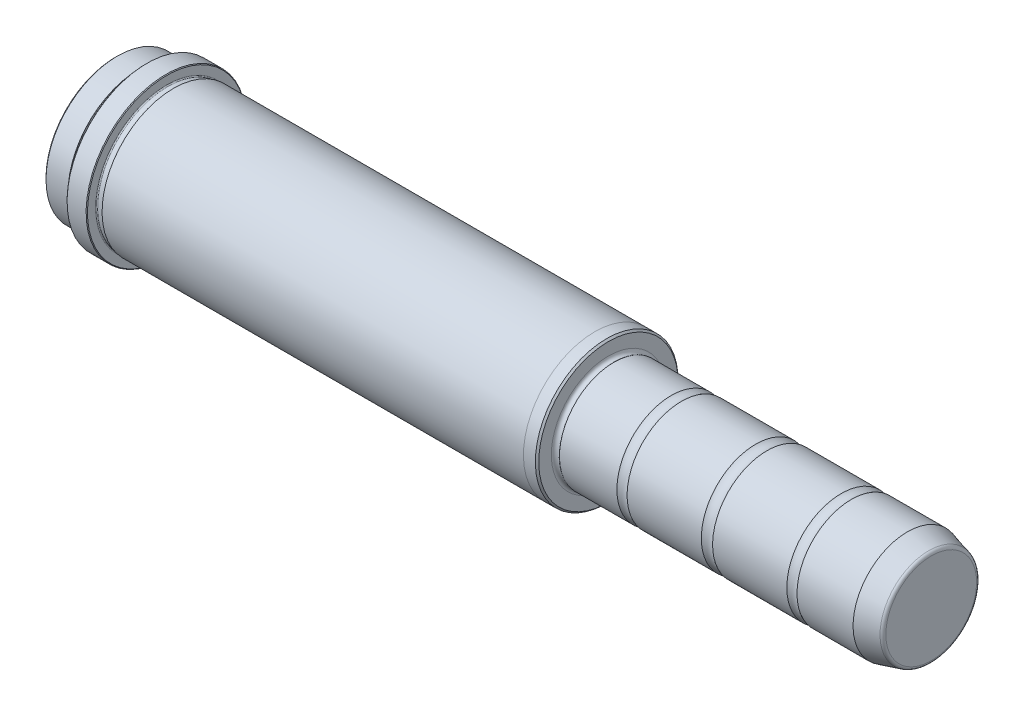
ISO-10303-21;
HEADER;
FILE_DESCRIPTION(('STEP AP214'),'2;1');
FILE_NAME('part.step','',(''),(''),'','','');
FILE_SCHEMA(('AUTOMOTIVE_DESIGN { 1 0 10303 214 1 1 1 1 }'));
ENDSEC;
DATA;
#1=APPLICATION_CONTEXT('core data for automotive mechanical design processes');
#2=APPLICATION_PROTOCOL_DEFINITION('international standard','automotive_design',2000,#1);
#3=PRODUCT_CONTEXT('',#1,'mechanical');
#4=PRODUCT('Part','Part','',(#3));
#5=PRODUCT_RELATED_PRODUCT_CATEGORY('part','',(#4));
#6=PRODUCT_DEFINITION_FORMATION('','',#4);
#7=PRODUCT_DEFINITION_CONTEXT('part definition',#1,'design');
#8=PRODUCT_DEFINITION('design','',#6,#7);
#9=PRODUCT_DEFINITION_SHAPE('','',#8);
#10=(LENGTH_UNIT() NAMED_UNIT(*) SI_UNIT(.MILLI.,.METRE.));
#11=(NAMED_UNIT(*) PLANE_ANGLE_UNIT() SI_UNIT($,.RADIAN.));
#12=(NAMED_UNIT(*) SI_UNIT($,.STERADIAN.) SOLID_ANGLE_UNIT());
#13=UNCERTAINTY_MEASURE_WITH_UNIT(LENGTH_MEASURE(1.E-05),#10,'distance_accuracy_value','');
#14=(GEOMETRIC_REPRESENTATION_CONTEXT(3) GLOBAL_UNCERTAINTY_ASSIGNED_CONTEXT((#13)) GLOBAL_UNIT_ASSIGNED_CONTEXT((#10,
#11,#12)) REPRESENTATION_CONTEXT('',''));
#15=CARTESIAN_POINT('',(0.,0.,0.));
#16=DIRECTION('',(0.,0.,1.));
#17=DIRECTION('',(1.,0.,0.));
#18=AXIS2_PLACEMENT_3D('',#15,#16,#17);
#19=CARTESIAN_POINT('',(95.,0.,0.));
#20=DIRECTION('',(1.,0.,0.));
#21=DIRECTION('',(0.,1.,0.));
#22=AXIS2_PLACEMENT_3D('',#19,#20,#21);
#23=CYLINDRICAL_SURFACE('',#22,16.);
#24=CARTESIAN_POINT('',(1.6,0.,0.));
#25=DIRECTION('',(1.,0.,0.));
#26=DIRECTION('',(0.,1.,0.));
#27=AXIS2_PLACEMENT_3D('',#24,#25,#26);
#28=CIRCLE('',#27,16.);
#29=CARTESIAN_POINT('',(1.6,16.,0.));
#30=VERTEX_POINT('',#29);
#31=EDGE_CURVE('E105',#30,#30,#28,.T.);
#32=ORIENTED_EDGE('',*,*,#31,.T.);
#33=EDGE_LOOP('',(#32));
#34=FACE_BOUND('',#33,.T.);
#35=CARTESIAN_POINT('',(18.5033370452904,0.,0.));
#36=DIRECTION('',(-1.,0.,0.));
#37=DIRECTION('',(0.,-1.,0.));
#38=AXIS2_PLACEMENT_3D('',#35,#36,#37);
#39=CIRCLE('',#38,16.);
#40=CARTESIAN_POINT('',(18.5033370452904,-16.,0.));
#41=VERTEX_POINT('',#40);
#42=EDGE_CURVE('E126',#41,#41,#39,.T.);
#43=ORIENTED_EDGE('',*,*,#42,.T.);
#44=EDGE_LOOP('',(#43));
#45=FACE_BOUND('',#44,.T.);
#46=ADVANCED_FACE('F28',(#34,#45),#23,.T.);
#47=CARTESIAN_POINT('',(-145.,21.,0.));
#48=DIRECTION('',(-1.,0.,0.));
#49=DIRECTION('',(0.,-1.,0.));
#50=AXIS2_PLACEMENT_3D('',#47,#48,#49);
#51=PLANE('',#50);
#52=CARTESIAN_POINT('',(-145.,0.,0.));
#53=DIRECTION('',(-1.,0.,0.));
#54=DIRECTION('',(0.,-1.,0.));
#55=AXIS2_PLACEMENT_3D('',#52,#53,#54);
#56=CIRCLE('',#55,20.5000000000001);
#57=CARTESIAN_POINT('',(-145.,-20.5000000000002,0.));
#58=VERTEX_POINT('',#57);
#59=EDGE_CURVE('E39',#58,#58,#56,.T.);
#60=ORIENTED_EDGE('',*,*,#59,.T.);
#61=EDGE_LOOP('',(#60));
#62=FACE_BOUND('',#61,.T.);
#63=ADVANCED_FACE('F149',(#62),#51,.T.);
#64=CARTESIAN_POINT('',(95.,0.,0.));
#65=DIRECTION('',(1.,0.,0.));
#66=DIRECTION('',(0.,1.,0.));
#67=AXIS2_PLACEMENT_3D('',#64,#65,#66);
#68=CYLINDRICAL_SURFACE('',#67,21.);
#69=CARTESIAN_POINT('',(-144.5,0.,0.));
#70=DIRECTION('',(-1.,0.,0.));
#71=DIRECTION('',(0.,-1.,0.));
#72=AXIS2_PLACEMENT_3D('',#69,#70,#71);
#73=CIRCLE('',#72,21.);
#74=CARTESIAN_POINT('',(-144.5,-21.0000000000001,0.));
#75=VERTEX_POINT('',#74);
#76=EDGE_CURVE('E43',#75,#75,#73,.F.);
#77=ORIENTED_EDGE('',*,*,#76,.T.);
#78=EDGE_LOOP('',(#77));
#79=FACE_BOUND('',#78,.T.);
#80=CARTESIAN_POINT('',(-138.,0.,0.));
#81=DIRECTION('',(1.,0.,0.));
#82=DIRECTION('',(0.,1.,0.));
#83=AXIS2_PLACEMENT_3D('',#80,#81,#82);
#84=CIRCLE('',#83,21.);
#85=CARTESIAN_POINT('',(-138.,21.,0.));
#86=VERTEX_POINT('',#85);
#87=EDGE_CURVE('E66',#86,#86,#84,.T.);
#88=ORIENTED_EDGE('',*,*,#87,.F.);
#89=EDGE_LOOP('',(#88));
#90=FACE_BOUND('',#89,.T.);
#91=ADVANCED_FACE('F157',(#79,#90),#68,.T.);
#92=CARTESIAN_POINT('',(-138.,20.9,0.));
#93=DIRECTION('',(1.,0.,0.));
#94=DIRECTION('',(0.,1.,0.));
#95=AXIS2_PLACEMENT_3D('',#92,#93,#94);
#96=PLANE('',#95);
#97=ORIENTED_EDGE('',*,*,#87,.T.);
#98=EDGE_LOOP('',(#97));
#99=FACE_BOUND('',#98,.T.);
#100=CARTESIAN_POINT('',(-138.,0.,0.));
#101=DIRECTION('',(1.,0.,0.));
#102=DIRECTION('',(0.,1.,0.));
#103=AXIS2_PLACEMENT_3D('',#100,#101,#102);
#104=CIRCLE('',#103,20.9);
#105=CARTESIAN_POINT('',(-138.,20.9,0.));
#106=VERTEX_POINT('',#105);
#107=EDGE_CURVE('E69',#106,#106,#104,.T.);
#108=ORIENTED_EDGE('',*,*,#107,.F.);
#109=EDGE_LOOP('',(#108));
#110=FACE_BOUND('',#109,.T.);
#111=ADVANCED_FACE('F405',(#99,#110),#96,.T.);
#112=CARTESIAN_POINT('',(-137.7,0.,0.));
#113=DIRECTION('',(1.,0.,0.));
#114=DIRECTION('',(0.,1.,0.));
#115=AXIS2_PLACEMENT_3D('',#112,#113,#114);
#116=TOROIDAL_SURFACE('',#115,20.9,0.299999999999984);
#117=ORIENTED_EDGE('',*,*,#107,.T.);
#118=EDGE_LOOP('',(#117));
#119=FACE_BOUND('',#118,.T.);
#120=CARTESIAN_POINT('',(-137.7,0.,0.));
#121=DIRECTION('',(1.,0.,0.));
#122=DIRECTION('',(0.,1.,0.));
#123=AXIS2_PLACEMENT_3D('',#120,#121,#122);
#124=CIRCLE('',#123,20.6);
#125=CARTESIAN_POINT('',(-137.7,20.6,0.));
#126=VERTEX_POINT('',#125);
#127=EDGE_CURVE('E72',#126,#126,#124,.T.);
#128=ORIENTED_EDGE('',*,*,#127,.F.);
#129=EDGE_LOOP('',(#128));
#130=FACE_BOUND('',#129,.T.);
#131=ADVANCED_FACE('F396',(#119,#130),#116,.F.);
#132=CARTESIAN_POINT('',(95.,0.,0.));
#133=DIRECTION('',(1.,0.,0.));
#134=DIRECTION('',(0.,1.,0.));
#135=AXIS2_PLACEMENT_3D('',#132,#133,#134);
#136=CYLINDRICAL_SURFACE('',#135,20.6);
#137=ORIENTED_EDGE('',*,*,#127,.T.);
#138=EDGE_LOOP('',(#137));
#139=FACE_BOUND('',#138,.T.);
#140=CARTESIAN_POINT('',(-136.3,0.,0.));
#141=DIRECTION('',(1.,0.,0.));
#142=DIRECTION('',(0.,1.,0.));
#143=AXIS2_PLACEMENT_3D('',#140,#141,#142);
#144=CIRCLE('',#143,20.6);
#145=CARTESIAN_POINT('',(-136.3,20.6,0.));
#146=VERTEX_POINT('',#145);
#147=EDGE_CURVE('E75',#146,#146,#144,.T.);
#148=ORIENTED_EDGE('',*,*,#147,.F.);
#149=EDGE_LOOP('',(#148));
#150=FACE_BOUND('',#149,.T.);
#151=ADVANCED_FACE('F387',(#139,#150),#136,.T.);
#152=CARTESIAN_POINT('',(-136.3,0.,0.));
#153=DIRECTION('',(1.,0.,0.));
#154=DIRECTION('',(0.,1.,0.));
#155=AXIS2_PLACEMENT_3D('',#152,#153,#154);
#156=TOROIDAL_SURFACE('',#155,20.9,0.3);
#157=ORIENTED_EDGE('',*,*,#147,.T.);
#158=EDGE_LOOP('',(#157));
#159=FACE_BOUND('',#158,.T.);
#160=CARTESIAN_POINT('',(-136.,0.,0.));
#161=DIRECTION('',(1.,0.,0.));
#162=DIRECTION('',(0.,1.,0.));
#163=AXIS2_PLACEMENT_3D('',#160,#161,#162);
#164=CIRCLE('',#163,20.9);
#165=CARTESIAN_POINT('',(-136.,20.9,0.));
#166=VERTEX_POINT('',#165);
#167=EDGE_CURVE('E78',#166,#166,#164,.T.);
#168=ORIENTED_EDGE('',*,*,#167,.F.);
#169=EDGE_LOOP('',(#168));
#170=FACE_BOUND('',#169,.T.);
#171=ADVANCED_FACE('F379',(#159,#170),#156,.F.);
#172=CARTESIAN_POINT('',(-136.,23.5,0.));
#173=DIRECTION('',(-1.,0.,0.));
#174=DIRECTION('',(0.,-1.,0.));
#175=AXIS2_PLACEMENT_3D('',#172,#173,#174);
#176=PLANE('',#175);
#177=CARTESIAN_POINT('',(-136.,0.,0.));
#178=DIRECTION('',(-1.,0.,0.));
#179=DIRECTION('',(0.,-1.,0.));
#180=AXIS2_PLACEMENT_3D('',#177,#178,#179);
#181=CIRCLE('',#180,23.3);
#182=CARTESIAN_POINT('',(-136.,-23.3000000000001,0.));
#183=VERTEX_POINT('',#182);
#184=EDGE_CURVE('E51',#183,#183,#181,.T.);
#185=ORIENTED_EDGE('',*,*,#184,.T.);
#186=EDGE_LOOP('',(#185));
#187=FACE_BOUND('',#186,.T.);
#188=ORIENTED_EDGE('',*,*,#167,.T.);
#189=EDGE_LOOP('',(#188));
#190=FACE_BOUND('',#189,.T.);
#191=ADVANCED_FACE('F371',(#187,#190),#176,.T.);
#192=CARTESIAN_POINT('',(95.,0.,0.));
#193=DIRECTION('',(1.,0.,0.));
#194=DIRECTION('',(0.,1.,0.));
#195=AXIS2_PLACEMENT_3D('',#192,#193,#194);
#196=CYLINDRICAL_SURFACE('',#195,23.5);
#197=CARTESIAN_POINT('',(-135.8,0.,0.));
#198=DIRECTION('',(-1.,0.,0.));
#199=DIRECTION('',(0.,-1.,0.));
#200=AXIS2_PLACEMENT_3D('',#197,#198,#199);
#201=CIRCLE('',#200,23.5);
#202=CARTESIAN_POINT('',(-135.8,-23.5,0.));
#203=VERTEX_POINT('',#202);
#204=EDGE_CURVE('E54',#203,#203,#201,.F.);
#205=ORIENTED_EDGE('',*,*,#204,.T.);
#206=EDGE_LOOP('',(#205));
#207=FACE_BOUND('',#206,.T.);
#208=CARTESIAN_POINT('',(-130.2,0.,0.));
#209=DIRECTION('',(1.,0.,0.));
#210=DIRECTION('',(0.,1.,0.));
#211=AXIS2_PLACEMENT_3D('',#208,#209,#210);
#212=CIRCLE('',#211,23.5);
#213=CARTESIAN_POINT('',(-130.2,-23.5,0.));
#214=VERTEX_POINT('',#213);
#215=EDGE_CURVE('E57',#214,#214,#212,.F.);
#216=ORIENTED_EDGE('',*,*,#215,.T.);
#217=EDGE_LOOP('',(#216));
#218=FACE_BOUND('',#217,.T.);
#219=ADVANCED_FACE('F362',(#207,#218),#196,.T.);
#220=CARTESIAN_POINT('',(-130.,20.9,0.));
#221=DIRECTION('',(1.,0.,0.));
#222=DIRECTION('',(0.,1.,0.));
#223=AXIS2_PLACEMENT_3D('',#220,#221,#222);
#224=PLANE('',#223);
#225=CARTESIAN_POINT('',(-130.,0.,0.));
#226=DIRECTION('',(1.,0.,0.));
#227=DIRECTION('',(0.,1.,0.));
#228=AXIS2_PLACEMENT_3D('',#225,#226,#227);
#229=CIRCLE('',#228,23.3);
#230=CARTESIAN_POINT('',(-130.,-23.3000000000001,0.));
#231=VERTEX_POINT('',#230);
#232=EDGE_CURVE('E48',#231,#231,#229,.T.);
#233=ORIENTED_EDGE('',*,*,#232,.T.);
#234=EDGE_LOOP('',(#233));
#235=FACE_BOUND('',#234,.T.);
#236=CARTESIAN_POINT('',(-130.,0.,0.));
#237=DIRECTION('',(1.,0.,0.));
#238=DIRECTION('',(0.,1.,0.));
#239=AXIS2_PLACEMENT_3D('',#236,#237,#238);
#240=CIRCLE('',#239,20.9);
#241=CARTESIAN_POINT('',(-130.,20.9,0.));
#242=VERTEX_POINT('',#241);
#243=EDGE_CURVE('E81',#242,#242,#240,.T.);
#244=ORIENTED_EDGE('',*,*,#243,.F.);
#245=EDGE_LOOP('',(#244));
#246=FACE_BOUND('',#245,.T.);
#247=ADVANCED_FACE('F353',(#235,#246),#224,.T.);
#248=CARTESIAN_POINT('',(-129.7,0.,0.));
#249=DIRECTION('',(1.,0.,0.));
#250=DIRECTION('',(0.,1.,0.));
#251=AXIS2_PLACEMENT_3D('',#248,#249,#250);
#252=TOROIDAL_SURFACE('',#251,20.9,0.299999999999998);
#253=ORIENTED_EDGE('',*,*,#243,.T.);
#254=EDGE_LOOP('',(#253));
#255=FACE_BOUND('',#254,.T.);
#256=CARTESIAN_POINT('',(-129.7,0.,0.));
#257=DIRECTION('',(1.,0.,0.));
#258=DIRECTION('',(0.,1.,0.));
#259=AXIS2_PLACEMENT_3D('',#256,#257,#258);
#260=CIRCLE('',#259,20.6);
#261=CARTESIAN_POINT('',(-129.7,20.6,0.));
#262=VERTEX_POINT('',#261);
#263=EDGE_CURVE('E84',#262,#262,#260,.T.);
#264=ORIENTED_EDGE('',*,*,#263,.F.);
#265=EDGE_LOOP('',(#264));
#266=FACE_BOUND('',#265,.T.);
#267=ADVANCED_FACE('F344',(#255,#266),#252,.F.);
#268=CARTESIAN_POINT('',(95.,0.,0.));
#269=DIRECTION('',(1.,0.,0.));
#270=DIRECTION('',(0.,1.,0.));
#271=AXIS2_PLACEMENT_3D('',#268,#269,#270);
#272=CYLINDRICAL_SURFACE('',#271,20.6);
#273=ORIENTED_EDGE('',*,*,#263,.T.);
#274=EDGE_LOOP('',(#273));
#275=FACE_BOUND('',#274,.T.);
#276=CARTESIAN_POINT('',(-128.3,0.,0.));
#277=DIRECTION('',(1.,0.,0.));
#278=DIRECTION('',(0.,1.,0.));
#279=AXIS2_PLACEMENT_3D('',#276,#277,#278);
#280=CIRCLE('',#279,20.6);
#281=CARTESIAN_POINT('',(-128.3,20.6,0.));
#282=VERTEX_POINT('',#281);
#283=EDGE_CURVE('E87',#282,#282,#280,.T.);
#284=ORIENTED_EDGE('',*,*,#283,.F.);
#285=EDGE_LOOP('',(#284));
#286=FACE_BOUND('',#285,.T.);
#287=ADVANCED_FACE('F335',(#275,#286),#272,.T.);
#288=CARTESIAN_POINT('',(-128.3,0.,0.));
#289=DIRECTION('',(1.,0.,0.));
#290=DIRECTION('',(0.,1.,0.));
#291=AXIS2_PLACEMENT_3D('',#288,#289,#290);
#292=TOROIDAL_SURFACE('',#291,20.9,0.299999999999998);
#293=ORIENTED_EDGE('',*,*,#283,.T.);
#294=EDGE_LOOP('',(#293));
#295=FACE_BOUND('',#294,.T.);
#296=CARTESIAN_POINT('',(-128.,0.,0.));
#297=DIRECTION('',(1.,0.,0.));
#298=DIRECTION('',(0.,1.,0.));
#299=AXIS2_PLACEMENT_3D('',#296,#297,#298);
#300=CIRCLE('',#299,20.9);
#301=CARTESIAN_POINT('',(-128.,20.9,0.));
#302=VERTEX_POINT('',#301);
#303=EDGE_CURVE('E90',#302,#302,#300,.T.);
#304=ORIENTED_EDGE('',*,*,#303,.F.);
#305=EDGE_LOOP('',(#304));
#306=FACE_BOUND('',#305,.T.);
#307=ADVANCED_FACE('F326',(#295,#306),#292,.F.);
#308=CARTESIAN_POINT('',(-128.,21.0001,0.));
#309=DIRECTION('',(-1.,0.,0.));
#310=DIRECTION('',(0.,-1.,0.));
#311=AXIS2_PLACEMENT_3D('',#308,#309,#310);
#312=PLANE('',#311);
#313=ORIENTED_EDGE('',*,*,#303,.T.);
#314=EDGE_LOOP('',(#313));
#315=FACE_BOUND('',#314,.T.);
#316=CARTESIAN_POINT('',(-128.,0.,0.));
#317=DIRECTION('',(1.,0.,0.));
#318=DIRECTION('',(0.,1.,0.));
#319=AXIS2_PLACEMENT_3D('',#316,#317,#318);
#320=CIRCLE('',#319,21.0001);
#321=CARTESIAN_POINT('',(-128.,21.0001,0.));
#322=VERTEX_POINT('',#321);
#323=EDGE_CURVE('E93',#322,#322,#320,.T.);
#324=ORIENTED_EDGE('',*,*,#323,.F.);
#325=EDGE_LOOP('',(#324));
#326=FACE_BOUND('',#325,.T.);
#327=ADVANCED_FACE('F317',(#315,#326),#312,.T.);
#328=CARTESIAN_POINT('',(95.,0.,0.));
#329=DIRECTION('',(1.,0.,0.));
#330=DIRECTION('',(0.,1.,0.));
#331=AXIS2_PLACEMENT_3D('',#328,#329,#330);
#332=CYLINDRICAL_SURFACE('',#331,21.0001);
#333=ORIENTED_EDGE('',*,*,#323,.T.);
#334=EDGE_LOOP('',(#333));
#335=FACE_BOUND('',#334,.T.);
#336=CARTESIAN_POINT('',(-4.,0.,0.));
#337=DIRECTION('',(1.,0.,0.));
#338=DIRECTION('',(0.,1.,0.));
#339=AXIS2_PLACEMENT_3D('',#336,#337,#338);
#340=CIRCLE('',#339,21.0001);
#341=CARTESIAN_POINT('',(-4.00000000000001,21.0001,0.));
#342=VERTEX_POINT('',#341);
#343=EDGE_CURVE('E96',#342,#342,#340,.T.);
#344=ORIENTED_EDGE('',*,*,#343,.F.);
#345=EDGE_LOOP('',(#344));
#346=FACE_BOUND('',#345,.T.);
#347=ADVANCED_FACE('F308',(#335,#346),#332,.T.);
#348=CARTESIAN_POINT('',(-4.,21.0001,0.));
#349=DIRECTION('',(1.,0.,0.));
#350=DIRECTION('',(0.,1.,0.));
#351=AXIS2_PLACEMENT_3D('',#348,#349,#350);
#352=PLANE('',#351);
#353=ORIENTED_EDGE('',*,*,#343,.T.);
#354=EDGE_LOOP('',(#353));
#355=FACE_BOUND('',#354,.T.);
#356=CARTESIAN_POINT('',(-4.,0.,0.));
#357=DIRECTION('',(1.,0.,0.));
#358=DIRECTION('',(0.,1.,0.));
#359=AXIS2_PLACEMENT_3D('',#356,#357,#358);
#360=CIRCLE('',#359,21.);
#361=CARTESIAN_POINT('',(-4.00000000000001,21.,0.));
#362=VERTEX_POINT('',#361);
#363=EDGE_CURVE('E99',#362,#362,#360,.T.);
#364=ORIENTED_EDGE('',*,*,#363,.F.);
#365=EDGE_LOOP('',(#364));
#366=FACE_BOUND('',#365,.T.);
#367=ADVANCED_FACE('F300',(#355,#366),#352,.T.);
#368=CARTESIAN_POINT('',(95.,0.,0.));
#369=DIRECTION('',(1.,0.,0.));
#370=DIRECTION('',(0.,1.,0.));
#371=AXIS2_PLACEMENT_3D('',#368,#369,#370);
#372=CYLINDRICAL_SURFACE('',#371,21.);
#373=CARTESIAN_POINT('',(-0.5,0.,0.));
#374=DIRECTION('',(1.,0.,0.));
#375=DIRECTION('',(0.,1.,0.));
#376=AXIS2_PLACEMENT_3D('',#373,#374,#375);
#377=CIRCLE('',#376,21.);
#378=CARTESIAN_POINT('',(-0.500000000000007,21.,0.));
#379=VERTEX_POINT('',#378);
#380=EDGE_CURVE('E10',#379,#379,#377,.F.);
#381=ORIENTED_EDGE('',*,*,#380,.T.);
#382=EDGE_LOOP('',(#381));
#383=FACE_BOUND('',#382,.T.);
#384=ORIENTED_EDGE('',*,*,#363,.T.);
#385=EDGE_LOOP('',(#384));
#386=FACE_BOUND('',#385,.T.);
#387=ADVANCED_FACE('F292',(#383,#386),#372,.T.);
#388=CARTESIAN_POINT('',(0.,16.8,0.));
#389=DIRECTION('',(1.,0.,0.));
#390=DIRECTION('',(0.,1.,0.));
#391=AXIS2_PLACEMENT_3D('',#388,#389,#390);
#392=PLANE('',#391);
#393=CARTESIAN_POINT('',(0.,0.,0.));
#394=DIRECTION('',(1.,0.,0.));
#395=DIRECTION('',(0.,1.,0.));
#396=AXIS2_PLACEMENT_3D('',#393,#394,#395);
#397=CIRCLE('',#396,20.5);
#398=CARTESIAN_POINT('',(0.,20.5,0.));
#399=VERTEX_POINT('',#398);
#400=EDGE_CURVE('E35',#399,#399,#397,.T.);
#401=ORIENTED_EDGE('',*,*,#400,.T.);
#402=EDGE_LOOP('',(#401));
#403=FACE_BOUND('',#402,.T.);
#404=CARTESIAN_POINT('',(0.,0.,0.));
#405=DIRECTION('',(1.,0.,0.));
#406=DIRECTION('',(0.,1.,0.));
#407=AXIS2_PLACEMENT_3D('',#404,#405,#406);
#408=CIRCLE('',#407,16.8);
#409=CARTESIAN_POINT('',(0.,16.8,0.));
#410=VERTEX_POINT('',#409);
#411=EDGE_CURVE('E102',#410,#410,#408,.T.);
#412=ORIENTED_EDGE('',*,*,#411,.F.);
#413=EDGE_LOOP('',(#412));
#414=FACE_BOUND('',#413,.T.);
#415=ADVANCED_FACE('F144',(#403,#414),#392,.T.);
#416=CARTESIAN_POINT('',(1.,0.,0.));
#417=DIRECTION('',(1.,0.,0.));
#418=DIRECTION('',(0.,1.,0.));
#419=AXIS2_PLACEMENT_3D('',#416,#417,#418);
#420=TOROIDAL_SURFACE('',#419,16.8,0.999999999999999);
#421=ORIENTED_EDGE('',*,*,#411,.T.);
#422=EDGE_LOOP('',(#421));
#423=FACE_BOUND('',#422,.T.);
#424=ORIENTED_EDGE('',*,*,#31,.F.);
#425=EDGE_LOOP('',(#424));
#426=FACE_BOUND('',#425,.T.);
#427=ADVANCED_FACE('F134',(#423,#426),#420,.F.);
#428=CARTESIAN_POINT('',(20.,0.,0.));
#429=DIRECTION('',(-1.,0.,0.));
#430=DIRECTION('',(0.,-1.,0.));
#431=AXIS2_PLACEMENT_3D('',#428,#429,#430);
#432=TOROIDAL_SURFACE('',#431,18.6,3.);
#433=CARTESIAN_POINT('',(21.4966629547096,0.,0.));
#434=DIRECTION('',(-1.,0.,0.));
#435=DIRECTION('',(0.,-1.,0.));
#436=AXIS2_PLACEMENT_3D('',#433,#434,#435);
#437=CIRCLE('',#436,16.);
#438=CARTESIAN_POINT('',(21.4966629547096,-16.,0.));
#439=VERTEX_POINT('',#438);
#440=EDGE_CURVE('E123',#439,#439,#437,.T.);
#441=ORIENTED_EDGE('',*,*,#440,.T.);
#442=EDGE_LOOP('',(#441));
#443=FACE_BOUND('',#442,.T.);
#444=ORIENTED_EDGE('',*,*,#42,.F.);
#445=EDGE_LOOP('',(#444));
#446=FACE_BOUND('',#445,.T.);
#447=ADVANCED_FACE('F131',(#443,#446),#432,.F.);
#448=CARTESIAN_POINT('',(95.,14.1243556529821,0.));
#449=DIRECTION('',(1.,0.,0.));
#450=DIRECTION('',(0.,1.,0.));
#451=AXIS2_PLACEMENT_3D('',#448,#449,#450);
#452=PLANE('',#451);
#453=CARTESIAN_POINT('',(95.,0.,0.));
#454=DIRECTION('',(1.,0.,0.));
#455=DIRECTION('',(0.,1.,0.));
#456=AXIS2_PLACEMENT_3D('',#453,#454,#455);
#457=CIRCLE('',#456,13.3570286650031);
#458=CARTESIAN_POINT('',(95.,13.3570286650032,0.));
#459=VERTEX_POINT('',#458);
#460=EDGE_CURVE('E63',#459,#459,#457,.T.);
#461=ORIENTED_EDGE('',*,*,#460,.T.);
#462=EDGE_LOOP('',(#461));
#463=FACE_BOUND('',#462,.T.);
#464=ADVANCED_FACE('F133',(#463),#452,.T.);
#465=CARTESIAN_POINT('',(95.,0.,0.));
#466=DIRECTION('',(-1.,0.,0.));
#467=DIRECTION('',(0.,-1.,0.));
#468=AXIS2_PLACEMENT_3D('',#465,#466,#467);
#469=CONICAL_SURFACE('',#468,14.1243556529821,0.261799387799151);
#470=CARTESIAN_POINT('',(94.2588190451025,0.,0.));
#471=DIRECTION('',(1.,0.,0.));
#472=DIRECTION('',(0.,1.,0.));
#473=AXIS2_PLACEMENT_3D('',#470,#471,#472);
#474=CIRCLE('',#473,14.3229544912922);
#475=CARTESIAN_POINT('',(94.2588190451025,14.3229544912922,0.));
#476=VERTEX_POINT('',#475);
#477=EDGE_CURVE('E60',#476,#476,#474,.F.);
#478=ORIENTED_EDGE('',*,*,#477,.T.);
#479=EDGE_LOOP('',(#478));
#480=FACE_BOUND('',#479,.T.);
#481=CARTESIAN_POINT('',(88.,0.,0.));
#482=DIRECTION('',(1.,0.,0.));
#483=DIRECTION('',(0.,1.,0.));
#484=AXIS2_PLACEMENT_3D('',#481,#482,#483);
#485=CIRCLE('',#484,16.);
#486=CARTESIAN_POINT('',(88.,16.,0.));
#487=VERTEX_POINT('',#486);
#488=EDGE_CURVE('E108',#487,#487,#485,.T.);
#489=ORIENTED_EDGE('',*,*,#488,.T.);
#490=EDGE_LOOP('',(#489));
#491=FACE_BOUND('',#490,.T.);
#492=ADVANCED_FACE('F141',(#480,#491),#469,.T.);
#493=ORIENTED_EDGE('',*,*,#488,.F.);
#494=EDGE_LOOP('',(#493));
#495=FACE_BOUND('',#494,.T.);
#496=CARTESIAN_POINT('',(71.4966629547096,0.,0.));
#497=DIRECTION('',(-1.,0.,0.));
#498=DIRECTION('',(0.,-1.,0.));
#499=AXIS2_PLACEMENT_3D('',#496,#497,#498);
#500=CIRCLE('',#499,16.);
#501=CARTESIAN_POINT('',(71.4966629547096,-16.,0.));
#502=VERTEX_POINT('',#501);
#503=EDGE_CURVE('E111',#502,#502,#500,.T.);
#504=ORIENTED_EDGE('',*,*,#503,.F.);
#505=EDGE_LOOP('',(#504));
#506=FACE_BOUND('',#505,.T.);
#507=ADVANCED_FACE('F153',(#495,#506),#23,.T.);
#508=CARTESIAN_POINT('',(70.,0.,0.));
#509=DIRECTION('',(-1.,0.,0.));
#510=DIRECTION('',(0.,-1.,0.));
#511=AXIS2_PLACEMENT_3D('',#508,#509,#510);
#512=TOROIDAL_SURFACE('',#511,18.6,3.);
#513=ORIENTED_EDGE('',*,*,#503,.T.);
#514=EDGE_LOOP('',(#513));
#515=FACE_BOUND('',#514,.T.);
#516=CARTESIAN_POINT('',(68.5033370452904,0.,0.));
#517=DIRECTION('',(-1.,0.,0.));
#518=DIRECTION('',(0.,-1.,0.));
#519=AXIS2_PLACEMENT_3D('',#516,#517,#518);
#520=CIRCLE('',#519,16.);
#521=CARTESIAN_POINT('',(68.5033370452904,-16.,0.));
#522=VERTEX_POINT('',#521);
#523=EDGE_CURVE('E114',#522,#522,#520,.T.);
#524=ORIENTED_EDGE('',*,*,#523,.F.);
#525=EDGE_LOOP('',(#524));
#526=FACE_BOUND('',#525,.T.);
#527=ADVANCED_FACE('F167',(#515,#526),#512,.F.);
#528=ORIENTED_EDGE('',*,*,#523,.T.);
#529=EDGE_LOOP('',(#528));
#530=FACE_BOUND('',#529,.T.);
#531=CARTESIAN_POINT('',(46.6583123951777,0.,0.));
#532=DIRECTION('',(-1.,0.,0.));
#533=DIRECTION('',(0.,-1.,0.));
#534=AXIS2_PLACEMENT_3D('',#531,#532,#533);
#535=CIRCLE('',#534,16.);
#536=CARTESIAN_POINT('',(46.6583123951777,-16.,0.));
#537=VERTEX_POINT('',#536);
#538=EDGE_CURVE('E117',#537,#537,#535,.T.);
#539=ORIENTED_EDGE('',*,*,#538,.F.);
#540=EDGE_LOOP('',(#539));
#541=FACE_BOUND('',#540,.T.);
#542=ADVANCED_FACE('F165',(#530,#541),#23,.T.);
#543=CARTESIAN_POINT('',(45.,0.,0.));
#544=DIRECTION('',(-1.,0.,0.));
#545=DIRECTION('',(0.,-1.,0.));
#546=AXIS2_PLACEMENT_3D('',#543,#544,#545);
#547=TOROIDAL_SURFACE('',#546,18.5,3.);
#548=ORIENTED_EDGE('',*,*,#538,.T.);
#549=EDGE_LOOP('',(#548));
#550=FACE_BOUND('',#549,.T.);
#551=CARTESIAN_POINT('',(43.3416876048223,0.,0.));
#552=DIRECTION('',(-1.,0.,0.));
#553=DIRECTION('',(0.,-1.,0.));
#554=AXIS2_PLACEMENT_3D('',#551,#552,#553);
#555=CIRCLE('',#554,16.);
#556=CARTESIAN_POINT('',(43.3416876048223,-16.,0.));
#557=VERTEX_POINT('',#556);
#558=EDGE_CURVE('E120',#557,#557,#555,.T.);
#559=ORIENTED_EDGE('',*,*,#558,.F.);
#560=EDGE_LOOP('',(#559));
#561=FACE_BOUND('',#560,.T.);
#562=ADVANCED_FACE('F163',(#550,#561),#547,.F.);
#563=ORIENTED_EDGE('',*,*,#558,.T.);
#564=EDGE_LOOP('',(#563));
#565=FACE_BOUND('',#564,.T.);
#566=ORIENTED_EDGE('',*,*,#440,.F.);
#567=EDGE_LOOP('',(#566));
#568=FACE_BOUND('',#567,.T.);
#569=ADVANCED_FACE('F152',(#565,#568),#23,.T.);
#570=CARTESIAN_POINT('',(94.,0.,0.));
#571=DIRECTION('',(1.,0.,0.));
#572=DIRECTION('',(0.,1.,0.));
#573=AXIS2_PLACEMENT_3D('',#570,#571,#572);
#574=TOROIDAL_SURFACE('',#573,13.3570286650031,1.);
#575=ORIENTED_EDGE('',*,*,#477,.F.);
#576=EDGE_LOOP('',(#575));
#577=FACE_BOUND('',#576,.T.);
#578=ORIENTED_EDGE('',*,*,#460,.F.);
#579=EDGE_LOOP('',(#578));
#580=FACE_BOUND('',#579,.T.);
#581=ADVANCED_FACE('F162',(#577,#580),#574,.T.);
#582=CARTESIAN_POINT('',(-135.8,0.,0.));
#583=DIRECTION('',(1.,0.,0.));
#584=DIRECTION('',(0.,1.,0.));
#585=AXIS2_PLACEMENT_3D('',#582,#583,#584);
#586=CONICAL_SURFACE('',#585,23.5,0.78539816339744);
#587=ORIENTED_EDGE('',*,*,#184,.F.);
#588=EDGE_LOOP('',(#587));
#589=FACE_BOUND('',#588,.T.);
#590=ORIENTED_EDGE('',*,*,#204,.F.);
#591=EDGE_LOOP('',(#590));
#592=FACE_BOUND('',#591,.T.);
#593=ADVANCED_FACE('F205',(#589,#592),#586,.T.);
#594=CARTESIAN_POINT('',(-130.,0.,0.));
#595=DIRECTION('',(-1.,0.,0.));
#596=DIRECTION('',(0.,-1.,0.));
#597=AXIS2_PLACEMENT_3D('',#594,#595,#596);
#598=CONICAL_SURFACE('',#597,23.3,0.785398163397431);
#599=CARTESIAN_POINT('',(-130.2,-23.5,0.));
#600=CARTESIAN_POINT('',(-130.197916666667,-23.4979166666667,0.));
#601=CARTESIAN_POINT('',(-130.195833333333,-23.4958333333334,0.));
#602=CARTESIAN_POINT('',(-130.191666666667,-23.4916666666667,0.));
#603=CARTESIAN_POINT('',(-130.189583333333,-23.4895833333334,0.));
#604=CARTESIAN_POINT('',(-130.185416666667,-23.4854166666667,0.));
#605=CARTESIAN_POINT('',(-130.183333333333,-23.4833333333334,0.));
#606=CARTESIAN_POINT('',(-130.179166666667,-23.4791666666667,0.));
#607=CARTESIAN_POINT('',(-130.177083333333,-23.4770833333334,0.));
#608=CARTESIAN_POINT('',(-130.172916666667,-23.4729166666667,0.));
#609=CARTESIAN_POINT('',(-130.170833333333,-23.4708333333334,0.));
#610=CARTESIAN_POINT('',(-130.166666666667,-23.4666666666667,0.));
#611=CARTESIAN_POINT('',(-130.164583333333,-23.4645833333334,0.));
#612=CARTESIAN_POINT('',(-130.160416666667,-23.4604166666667,0.));
#613=CARTESIAN_POINT('',(-130.158333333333,-23.4583333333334,0.));
#614=CARTESIAN_POINT('',(-130.154166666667,-23.4541666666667,0.));
#615=CARTESIAN_POINT('',(-130.152083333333,-23.4520833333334,0.));
#616=CARTESIAN_POINT('',(-130.147916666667,-23.4479166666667,0.));
#617=CARTESIAN_POINT('',(-130.145833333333,-23.4458333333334,0.));
#618=CARTESIAN_POINT('',(-130.141666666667,-23.4416666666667,0.));
#619=CARTESIAN_POINT('',(-130.139583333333,-23.4395833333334,0.));
#620=CARTESIAN_POINT('',(-130.135416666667,-23.4354166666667,0.));
#621=CARTESIAN_POINT('',(-130.133333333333,-23.4333333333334,0.));
#622=CARTESIAN_POINT('',(-130.129166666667,-23.4291666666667,0.));
#623=CARTESIAN_POINT('',(-130.127083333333,-23.4270833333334,0.));
#624=CARTESIAN_POINT('',(-130.122916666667,-23.4229166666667,0.));
#625=CARTESIAN_POINT('',(-130.120833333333,-23.4208333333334,0.));
#626=CARTESIAN_POINT('',(-130.116666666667,-23.4166666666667,0.));
#627=CARTESIAN_POINT('',(-130.114583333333,-23.4145833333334,0.));
#628=CARTESIAN_POINT('',(-130.110416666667,-23.4104166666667,0.));
#629=CARTESIAN_POINT('',(-130.108333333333,-23.4083333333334,0.));
#630=CARTESIAN_POINT('',(-130.104166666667,-23.4041666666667,0.));
#631=CARTESIAN_POINT('',(-130.102083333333,-23.4020833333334,0.));
#632=CARTESIAN_POINT('',(-130.097916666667,-23.3979166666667,0.));
#633=CARTESIAN_POINT('',(-130.095833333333,-23.3958333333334,0.));
#634=CARTESIAN_POINT('',(-130.091666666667,-23.3916666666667,0.));
#635=CARTESIAN_POINT('',(-130.089583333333,-23.3895833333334,0.));
#636=CARTESIAN_POINT('',(-130.085416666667,-23.3854166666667,0.));
#637=CARTESIAN_POINT('',(-130.083333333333,-23.3833333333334,0.));
#638=CARTESIAN_POINT('',(-130.079166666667,-23.3791666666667,0.));
#639=CARTESIAN_POINT('',(-130.077083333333,-23.3770833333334,0.));
#640=CARTESIAN_POINT('',(-130.072916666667,-23.3729166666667,0.));
#641=CARTESIAN_POINT('',(-130.070833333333,-23.3708333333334,0.));
#642=CARTESIAN_POINT('',(-130.066666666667,-23.3666666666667,0.));
#643=CARTESIAN_POINT('',(-130.064583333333,-23.3645833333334,0.));
#644=CARTESIAN_POINT('',(-130.060416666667,-23.3604166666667,0.));
#645=CARTESIAN_POINT('',(-130.058333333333,-23.3583333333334,0.));
#646=CARTESIAN_POINT('',(-130.054166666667,-23.3541666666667,0.));
#647=CARTESIAN_POINT('',(-130.052083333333,-23.3520833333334,0.));
#648=CARTESIAN_POINT('',(-130.047916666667,-23.3479166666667,0.));
#649=CARTESIAN_POINT('',(-130.045833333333,-23.3458333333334,0.));
#650=CARTESIAN_POINT('',(-130.041666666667,-23.3416666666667,0.));
#651=CARTESIAN_POINT('',(-130.039583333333,-23.3395833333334,0.));
#652=CARTESIAN_POINT('',(-130.035416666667,-23.3354166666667,0.));
#653=CARTESIAN_POINT('',(-130.033333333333,-23.3333333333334,0.));
#654=CARTESIAN_POINT('',(-130.029166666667,-23.3291666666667,0.));
#655=CARTESIAN_POINT('',(-130.027083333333,-23.3270833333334,0.));
#656=CARTESIAN_POINT('',(-130.022916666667,-23.3229166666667,0.));
#657=CARTESIAN_POINT('',(-130.020833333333,-23.3208333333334,0.));
#658=CARTESIAN_POINT('',(-130.016666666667,-23.3166666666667,0.));
#659=CARTESIAN_POINT('',(-130.014583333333,-23.3145833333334,0.));
#660=CARTESIAN_POINT('',(-130.010416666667,-23.3104166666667,0.));
#661=CARTESIAN_POINT('',(-130.008333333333,-23.3083333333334,0.));
#662=CARTESIAN_POINT('',(-130.004166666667,-23.3041666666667,0.));
#663=CARTESIAN_POINT('',(-130.002083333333,-23.3020833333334,0.));
#664=CARTESIAN_POINT('',(-130.,-23.3000000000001,0.));
#665=B_SPLINE_CURVE_WITH_KNOTS('',3,(#599,#600,#601,#602,#603,#604,#605,#606,#607,#608,#609,
#610,#611,#612,#613,#614,#615,#616,#617,#618,#619,#620,#621,#622,#623,#624,#625,#626,#627,#628,
#629,#630,#631,#632,#633,#634,#635,#636,#637,#638,#639,#640,#641,#642,#643,#644,#645,#646,#647,
#648,#649,#650,#651,#652,#653,#654,#655,#656,#657,#658,#659,#660,#661,#662,#663,#664),
.UNSPECIFIED.,.F.,.F.,(4,2,2,2,2,2,2,2,2,2,2,2,2,2,2,2,2,2,2,2,2,2,2,2,2,2,2,2,2,2,2,2,4),(0.,
0.00883883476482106,0.0176776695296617,0.0265165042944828,0.0353553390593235,0.0441941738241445,
0.0530330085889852,0.0618718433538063,0.070710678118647,0.0795495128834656,0.0883883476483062,
0.0972271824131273,0.106066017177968,0.114904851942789,0.12374368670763,0.132582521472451,
0.141421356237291,0.150260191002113,0.159099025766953,0.167937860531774,0.176776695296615,
0.185615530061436,0.194454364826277,0.203293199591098,0.212132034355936,0.220970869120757,
0.229809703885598,0.238648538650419,0.24748737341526,0.256326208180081,0.265165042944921,
0.274003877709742,0.282842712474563),.UNSPECIFIED.);
#666=EDGE_CURVE('BSEAM215',#214,#231,#665,.T.);
#667=ORIENTED_EDGE('',*,*,#215,.F.);
#668=ORIENTED_EDGE('',*,*,#232,.F.);
#669=ORIENTED_EDGE('',*,*,#666,.T.);
#670=ORIENTED_EDGE('',*,*,#666,.F.);
#671=EDGE_LOOP('',(#667,#669,#668,#670));
#672=FACE_BOUND('',#671,.T.);
#673=ADVANCED_FACE('F215',(#672),#598,.T.);
#674=CARTESIAN_POINT('',(-144.5,0.,0.));
#675=DIRECTION('',(1.,0.,0.));
#676=DIRECTION('',(0.,1.,0.));
#677=AXIS2_PLACEMENT_3D('',#674,#675,#676);
#678=CONICAL_SURFACE('',#677,21.,0.785398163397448);
#679=ORIENTED_EDGE('',*,*,#59,.F.);
#680=EDGE_LOOP('',(#679));
#681=FACE_BOUND('',#680,.T.);
#682=ORIENTED_EDGE('',*,*,#76,.F.);
#683=EDGE_LOOP('',(#682));
#684=FACE_BOUND('',#683,.T.);
#685=ADVANCED_FACE('F224',(#681,#684),#678,.T.);
#686=CARTESIAN_POINT('',(0.,0.,0.));
#687=DIRECTION('',(-1.,0.,0.));
#688=DIRECTION('',(0.,-1.,0.));
#689=AXIS2_PLACEMENT_3D('',#686,#687,#688);
#690=CONICAL_SURFACE('',#689,20.5,0.785398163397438);
#691=ORIENTED_EDGE('',*,*,#380,.F.);
#692=EDGE_LOOP('',(#691));
#693=FACE_BOUND('',#692,.T.);
#694=ORIENTED_EDGE('',*,*,#400,.F.);
#695=EDGE_LOOP('',(#694));
#696=FACE_BOUND('',#695,.T.);
#697=ADVANCED_FACE('F30',(#693,#696),#690,.T.);
#698=CLOSED_SHELL('',(#46,#63,#91,#111,#131,#151,#171,#191,#219,#247,#267,#287,#307,#327,#347,
#367,#387,#415,#427,#447,#464,#492,#507,#527,#542,#562,#569,#581,#593,#673,#685,#697));
#699=MANIFOLD_SOLID_BREP('B2',#698);
#700=ADVANCED_BREP_SHAPE_REPRESENTATION('',(#18,#699),#14);
#701=SHAPE_DEFINITION_REPRESENTATION(#9,#700);
ENDSEC;
END-ISO-10303-21;
